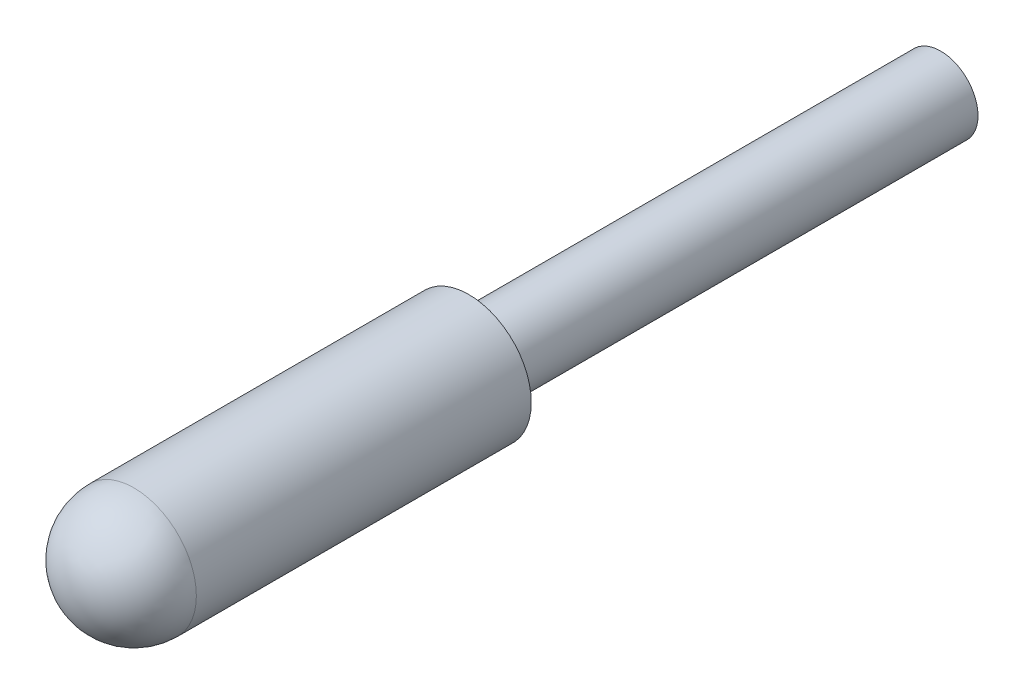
ISO-10303-21;
HEADER;
FILE_DESCRIPTION(('STEP AP214'),'2;1');
FILE_NAME('part.step','',(''),(''),'','','');
FILE_SCHEMA(('AUTOMOTIVE_DESIGN { 1 0 10303 214 1 1 1 1 }'));
ENDSEC;
DATA;
#1=APPLICATION_CONTEXT('core data for automotive mechanical design processes');
#2=APPLICATION_PROTOCOL_DEFINITION('international standard','automotive_design',2000,#1);
#3=PRODUCT_CONTEXT('',#1,'mechanical');
#4=PRODUCT('Part','Part','',(#3));
#5=PRODUCT_RELATED_PRODUCT_CATEGORY('part','',(#4));
#6=PRODUCT_DEFINITION_FORMATION('','',#4);
#7=PRODUCT_DEFINITION_CONTEXT('part definition',#1,'design');
#8=PRODUCT_DEFINITION('design','',#6,#7);
#9=PRODUCT_DEFINITION_SHAPE('','',#8);
#10=(LENGTH_UNIT() NAMED_UNIT(*) SI_UNIT(.MILLI.,.METRE.));
#11=(NAMED_UNIT(*) PLANE_ANGLE_UNIT() SI_UNIT($,.RADIAN.));
#12=(NAMED_UNIT(*) SI_UNIT($,.STERADIAN.) SOLID_ANGLE_UNIT());
#13=UNCERTAINTY_MEASURE_WITH_UNIT(LENGTH_MEASURE(1.E-05),#10,'distance_accuracy_value','');
#14=(GEOMETRIC_REPRESENTATION_CONTEXT(3) GLOBAL_UNCERTAINTY_ASSIGNED_CONTEXT((#13)) GLOBAL_UNIT_ASSIGNED_CONTEXT((#10,
#11,#12)) REPRESENTATION_CONTEXT('',''));
#15=CARTESIAN_POINT('',(0.,0.,0.));
#16=DIRECTION('',(0.,0.,1.));
#17=DIRECTION('',(1.,0.,0.));
#18=AXIS2_PLACEMENT_3D('',#15,#16,#17);
#19=CARTESIAN_POINT('',(0.,0.,-1.9939));
#20=DIRECTION('',(0.,0.,1.));
#21=DIRECTION('',(0.,1.,0.));
#22=AXIS2_PLACEMENT_3D('',#19,#20,#21);
#23=SPHERICAL_SURFACE('',#22,1.9939);
#24=CARTESIAN_POINT('',(0.,0.,-1.9939));
#25=DIRECTION('',(0.,0.,1.));
#26=DIRECTION('',(1.,0.,0.));
#27=AXIS2_PLACEMENT_3D('',#24,#25,#26);
#28=CIRCLE('',#27,1.9939);
#29=CARTESIAN_POINT('',(1.9939,0.,-1.9939));
#30=VERTEX_POINT('',#29);
#31=EDGE_CURVE('E54',#30,#30,#28,.T.);
#32=ORIENTED_EDGE('',*,*,#31,.T.);
#33=EDGE_LOOP('',(#32));
#34=FACE_BOUND('',#33,.T.);
#35=ADVANCED_FACE('F35',(#34),#23,.T.);
#36=CARTESIAN_POINT('',(0.,0.,-27.78125));
#37=DIRECTION('',(0.,0.,1.));
#38=DIRECTION('',(1.,0.,0.));
#39=AXIS2_PLACEMENT_3D('',#36,#37,#38);
#40=PLANE('',#39);
#41=CARTESIAN_POINT('',(0.,0.,-27.78125));
#42=DIRECTION('',(0.,0.,1.));
#43=DIRECTION('',(1.,0.,0.));
#44=AXIS2_PLACEMENT_3D('',#41,#42,#43);
#45=CIRCLE('',#44,1.1938);
#46=CARTESIAN_POINT('',(1.1938,0.,-27.78125));
#47=VERTEX_POINT('',#46);
#48=EDGE_CURVE('E10',#47,#47,#45,.T.);
#49=ORIENTED_EDGE('',*,*,#48,.F.);
#50=EDGE_LOOP('',(#49));
#51=FACE_BOUND('',#50,.T.);
#52=ADVANCED_FACE('F78',(#51),#40,.F.);
#53=CARTESIAN_POINT('',(0.,0.,0.));
#54=DIRECTION('',(0.,0.,1.));
#55=DIRECTION('',(1.,0.,0.));
#56=AXIS2_PLACEMENT_3D('',#53,#54,#55);
#57=CYLINDRICAL_SURFACE('',#56,1.1938);
#58=CARTESIAN_POINT('',(0.,0.,-13.096875));
#59=DIRECTION('',(0.,0.,1.));
#60=DIRECTION('',(1.,0.,0.));
#61=AXIS2_PLACEMENT_3D('',#58,#59,#60);
#62=CIRCLE('',#61,1.1938);
#63=CARTESIAN_POINT('',(1.1938,0.,-13.096875));
#64=VERTEX_POINT('',#63);
#65=EDGE_CURVE('E41',#64,#64,#62,.T.);
#66=ORIENTED_EDGE('',*,*,#65,.F.);
#67=EDGE_LOOP('',(#66));
#68=FACE_BOUND('',#67,.T.);
#69=ORIENTED_EDGE('',*,*,#48,.T.);
#70=EDGE_LOOP('',(#69));
#71=FACE_BOUND('',#70,.T.);
#72=ADVANCED_FACE('F73',(#68,#71),#57,.T.);
#73=CARTESIAN_POINT('',(0.,0.,-13.096875));
#74=DIRECTION('',(0.,0.,1.));
#75=DIRECTION('',(1.,0.,0.));
#76=AXIS2_PLACEMENT_3D('',#73,#74,#75);
#77=TOROIDAL_SURFACE('',#76,1.590675,0.396875);
#78=CARTESIAN_POINT('',(0.,0.,-12.7));
#79=DIRECTION('',(0.,0.,1.));
#80=DIRECTION('',(1.,0.,0.));
#81=AXIS2_PLACEMENT_3D('',#78,#79,#80);
#82=CIRCLE('',#81,1.590675);
#83=CARTESIAN_POINT('',(1.590675,0.,-12.7));
#84=VERTEX_POINT('',#83);
#85=EDGE_CURVE('E45',#84,#84,#82,.T.);
#86=ORIENTED_EDGE('',*,*,#85,.F.);
#87=EDGE_LOOP('',(#86));
#88=FACE_BOUND('',#87,.T.);
#89=ORIENTED_EDGE('',*,*,#65,.T.);
#90=EDGE_LOOP('',(#89));
#91=FACE_BOUND('',#90,.T.);
#92=ADVANCED_FACE('F68',(#88,#91),#77,.F.);
#93=CARTESIAN_POINT('',(0.,1.590675,-12.7));
#94=DIRECTION('',(0.,0.,1.));
#95=DIRECTION('',(1.,0.,0.));
#96=AXIS2_PLACEMENT_3D('',#93,#94,#95);
#97=PLANE('',#96);
#98=CARTESIAN_POINT('',(0.,0.,-12.7));
#99=DIRECTION('',(0.,0.,1.));
#100=DIRECTION('',(1.,0.,0.));
#101=AXIS2_PLACEMENT_3D('',#98,#99,#100);
#102=CIRCLE('',#101,1.9939);
#103=CARTESIAN_POINT('',(1.9939,0.,-12.7));
#104=VERTEX_POINT('',#103);
#105=EDGE_CURVE('E49',#104,#104,#102,.T.);
#106=ORIENTED_EDGE('',*,*,#105,.F.);
#107=EDGE_LOOP('',(#106));
#108=FACE_BOUND('',#107,.T.);
#109=ORIENTED_EDGE('',*,*,#85,.T.);
#110=EDGE_LOOP('',(#109));
#111=FACE_BOUND('',#110,.T.);
#112=ADVANCED_FACE('F62',(#108,#111),#97,.F.);
#113=CARTESIAN_POINT('',(0.,0.,0.));
#114=DIRECTION('',(0.,0.,1.));
#115=DIRECTION('',(1.,0.,0.));
#116=AXIS2_PLACEMENT_3D('',#113,#114,#115);
#117=CYLINDRICAL_SURFACE('',#116,1.9939);
#118=ORIENTED_EDGE('',*,*,#31,.F.);
#119=EDGE_LOOP('',(#118));
#120=FACE_BOUND('',#119,.T.);
#121=ORIENTED_EDGE('',*,*,#105,.T.);
#122=EDGE_LOOP('',(#121));
#123=FACE_BOUND('',#122,.T.);
#124=ADVANCED_FACE('F59',(#120,#123),#117,.T.);
#125=CLOSED_SHELL('',(#35,#52,#72,#92,#112,#124));
#126=MANIFOLD_SOLID_BREP('B2',#125);
#127=ADVANCED_BREP_SHAPE_REPRESENTATION('',(#18,#126),#14);
#128=SHAPE_DEFINITION_REPRESENTATION(#9,#127);
ENDSEC;
END-ISO-10303-21;
